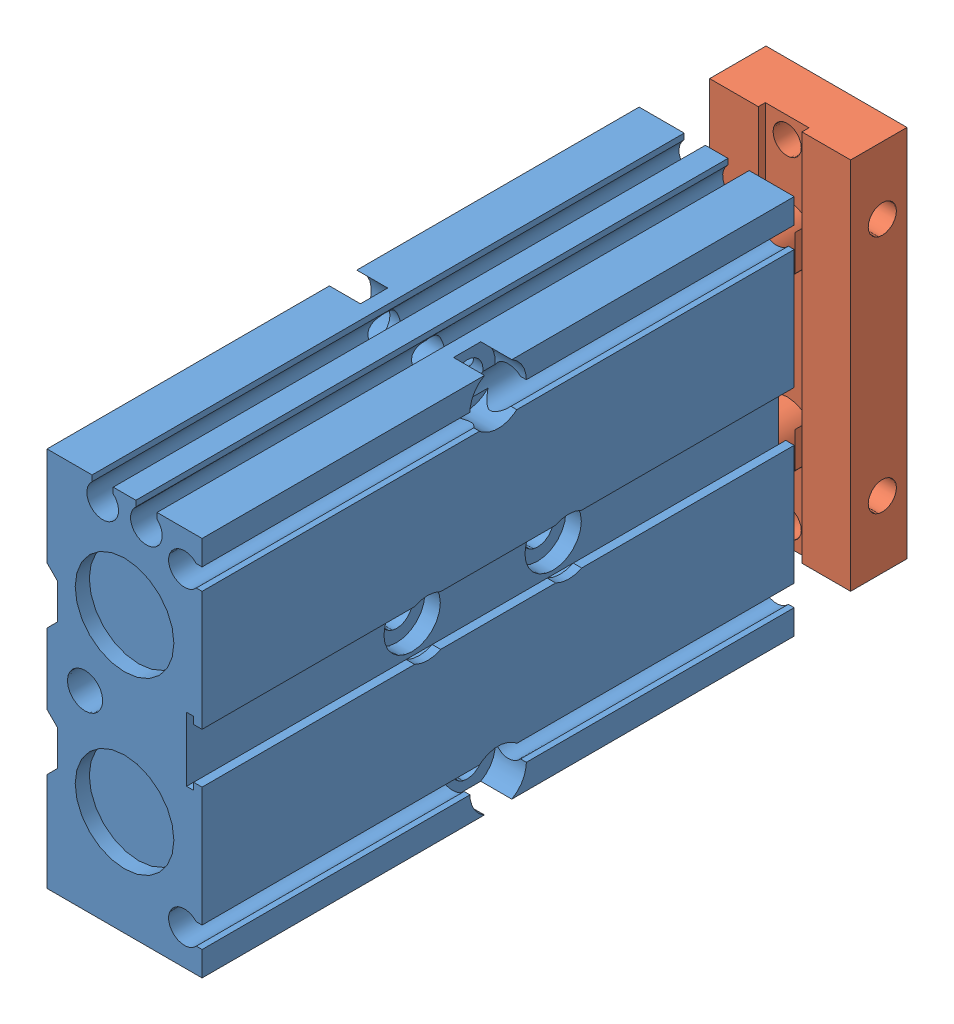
SolidWorks assembly TD16-30.SLDASM, configuration 默认 (file format 8000). Lengths in mm.
Overall size (22 54 101).
2 component instances, 2 part files, 3 mates.
Components (placement in the parent):
- TD16+30-1: TD16+30.SLDPRT [默认] at (-11.786 -2.6329 -89) size (22 54 84)
- TD16X30-1: TD16X30.SLDPRT [默认] at (-11.786 -2.6329 -59) size (20 53 47)
Mates (geometry in assembly coordinates):
- 同心1: concentric aligned: cylinder of TD16+30-1 through (-11.786 9.4671 -82) axis (0 0 1) radius 4; cylinder of TD16X30-1 through (-11.786 9.4671 -52) axis (0 0 1) radius 4
- 同心2: concentric aligned: cylinder of TD16+30-1 through (-11.786 -14.7329 -82) axis (0 0 1) radius 4; cylinder of TD16X30-1 through (-11.786 -14.7329 -52) axis (0 0 1) radius 4
- LimitDistance1: limit distance = 8 mm anti-aligned: plane of TD16X30-1 through (-17.386 -2.6329 -50) normal (0 0 1); plane of TD16+30-1 through (-11.786 -2.6329 -42) normal (0 0 -1)
